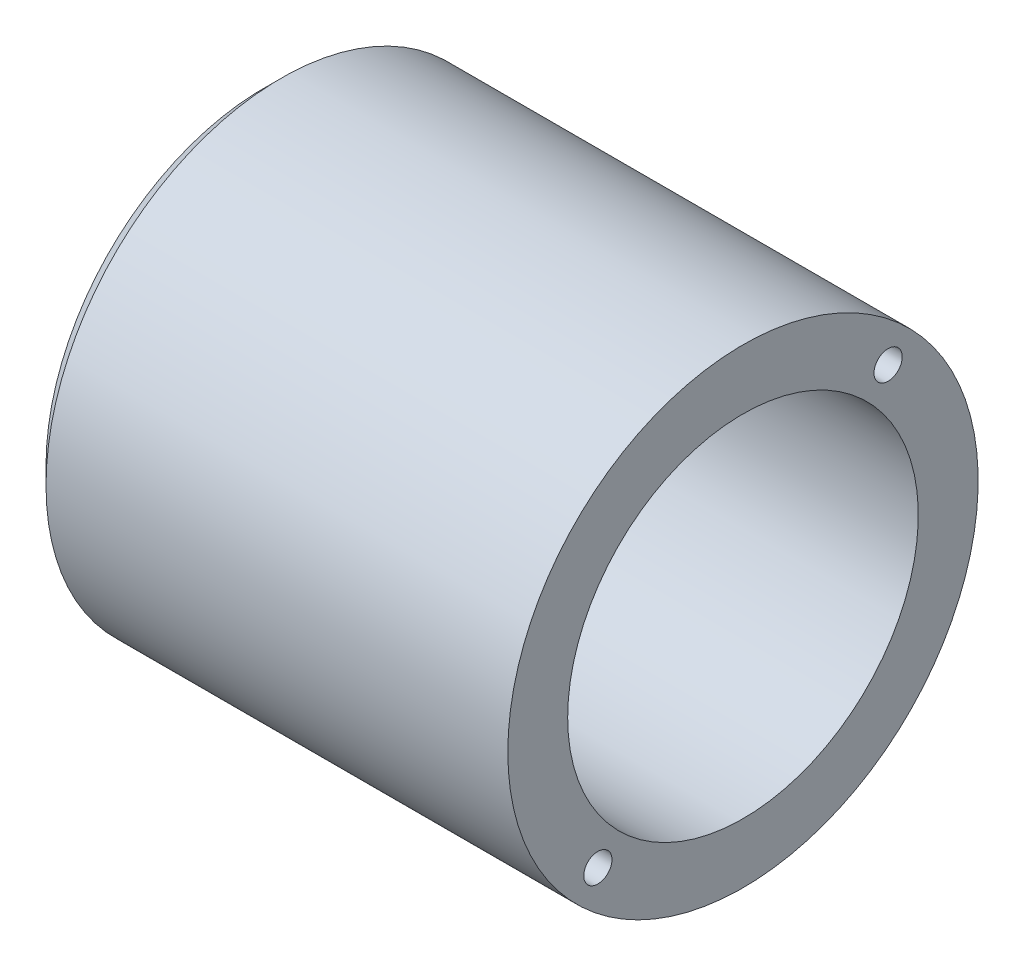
from build123d import *

# Parameters (mm, degrees)
FASE1_SIZE         = 2
KREISMUSTER1_COUNT = 2


with BuildPart() as part:
    # Skizze1 → Rotation1 (revolve)
    with BuildSketch(Plane.XY, mode=Mode.PRIVATE) as rotation1_sk:
        Polygon((-8.3, 27.5), (47.7, 27.5), (47.7, 20.5), (-3.3, 20.5), (-3.3, 0), (-8.3, 0), align=None)
    revolve(rotation1_sk.sketch.rotate(Axis((-200068.176472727, 0, 0), (1, 0, 0)), 90), axis=Axis((-200068.176472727, 0, 0), (1, 0, 0)))

    # Fase1
    fase1_edges = [part.edges().sort_by_distance(p)[0] for p in [
        (-8.3, 0, -27.5),
    ]]
    chamfer(fase1_edges, length=FASE1_SIZE)

    # Skizze2 → M4 Gewindebohrung1 (revolve, cut)
    with BuildSketch(Plane(origin=(47.7, 16.970562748, -16.970562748), x_dir=(0, 0, -1), z_dir=(0, 1, 0))):
        Polygon((0, 0), (0, 9.491420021), (1.65, 8.5), (1.65, 0), align=None)
    m4_gewindebohrung1 = revolve(axis=Axis((54.05, 16.970562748, -16.970562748), (-1, 0, 0)), mode=Mode.SUBTRACT)

    # Kreismuster1: M4 Gewindebohrung1 ×2 about axis
    kreismuster1_axis = Axis((0, 0, 0), (1, 0, 0))
    for i in range(1, KREISMUSTER1_COUNT):
        add(m4_gewindebohrung1.rotate(kreismuster1_axis, i * 360 / KREISMUSTER1_COUNT), mode=Mode.SUBTRACT)


solid = part.part
